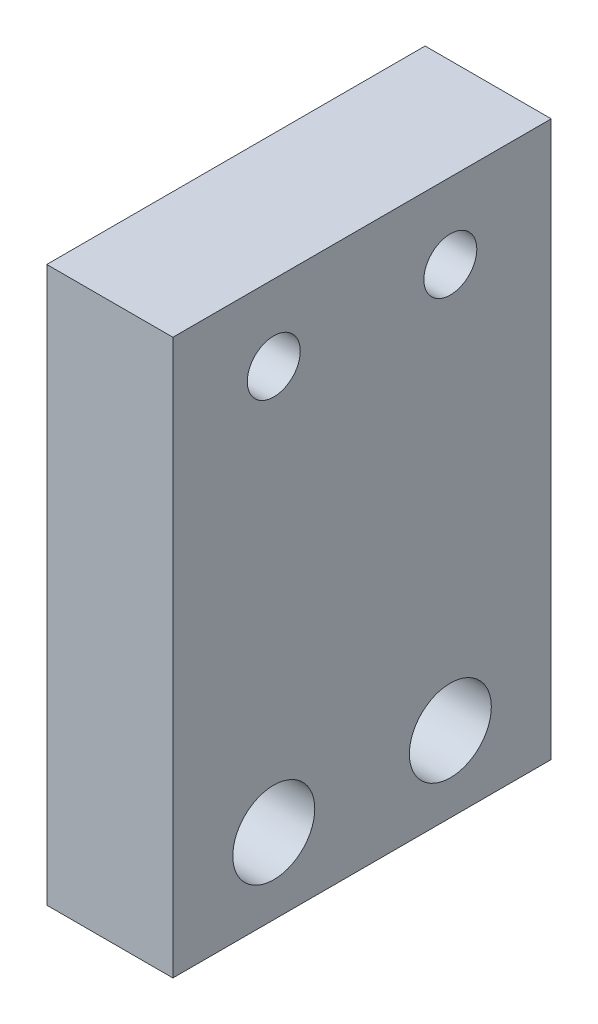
ISO-10303-21;
HEADER;
FILE_DESCRIPTION(('STEP AP214'),'2;1');
FILE_NAME('part.step','',(''),(''),'','','');
FILE_SCHEMA(('AUTOMOTIVE_DESIGN { 1 0 10303 214 1 1 1 1 }'));
ENDSEC;
DATA;
#1=APPLICATION_CONTEXT('core data for automotive mechanical design processes');
#2=APPLICATION_PROTOCOL_DEFINITION('international standard','automotive_design',2000,#1);
#3=PRODUCT_CONTEXT('',#1,'mechanical');
#4=PRODUCT('Part','Part','',(#3));
#5=PRODUCT_RELATED_PRODUCT_CATEGORY('part','',(#4));
#6=PRODUCT_DEFINITION_FORMATION('','',#4);
#7=PRODUCT_DEFINITION_CONTEXT('part definition',#1,'design');
#8=PRODUCT_DEFINITION('design','',#6,#7);
#9=PRODUCT_DEFINITION_SHAPE('','',#8);
#10=(LENGTH_UNIT() NAMED_UNIT(*) SI_UNIT(.MILLI.,.METRE.));
#11=(NAMED_UNIT(*) PLANE_ANGLE_UNIT() SI_UNIT($,.RADIAN.));
#12=(NAMED_UNIT(*) SI_UNIT($,.STERADIAN.) SOLID_ANGLE_UNIT());
#13=UNCERTAINTY_MEASURE_WITH_UNIT(LENGTH_MEASURE(1.E-05),#10,'distance_accuracy_value','');
#14=(GEOMETRIC_REPRESENTATION_CONTEXT(3) GLOBAL_UNCERTAINTY_ASSIGNED_CONTEXT((#13)) GLOBAL_UNIT_ASSIGNED_CONTEXT((#10,
#11,#12)) REPRESENTATION_CONTEXT('',''));
#15=CARTESIAN_POINT('',(0.,0.,0.));
#16=DIRECTION('',(0.,0.,1.));
#17=DIRECTION('',(1.,0.,0.));
#18=AXIS2_PLACEMENT_3D('',#15,#16,#17);
#19=CARTESIAN_POINT('',(-20.,6.,22.));
#20=DIRECTION('',(1.,0.,0.));
#21=DIRECTION('',(0.,0.,-1.));
#22=AXIS2_PLACEMENT_3D('',#19,#20,#21);
#23=CYLINDRICAL_SURFACE('',#22,3.25);
#24=CARTESIAN_POINT('',(10.,6.,22.));
#25=DIRECTION('',(1.,0.,0.));
#26=DIRECTION('',(0.,0.,-1.));
#27=AXIS2_PLACEMENT_3D('',#24,#25,#26);
#28=CIRCLE('',#27,3.25);
#29=CARTESIAN_POINT('',(10.,6.,18.75));
#30=VERTEX_POINT('',#29);
#31=EDGE_CURVE('E102',#30,#30,#28,.T.);
#32=ORIENTED_EDGE('',*,*,#31,.T.);
#33=EDGE_LOOP('',(#32));
#34=FACE_BOUND('',#33,.T.);
#35=CARTESIAN_POINT('',(4.5,6.,22.));
#36=DIRECTION('',(-1.,0.,0.));
#37=DIRECTION('',(0.,0.,1.));
#38=AXIS2_PLACEMENT_3D('',#35,#36,#37);
#39=CIRCLE('',#38,3.25);
#40=CARTESIAN_POINT('',(4.5,6.,25.25));
#41=VERTEX_POINT('',#40);
#42=EDGE_CURVE('E36',#41,#41,#39,.F.);
#43=ORIENTED_EDGE('',*,*,#42,.F.);
#44=EDGE_LOOP('',(#43));
#45=FACE_BOUND('',#44,.T.);
#46=ADVANCED_FACE('F32',(#34,#45),#23,.F.);
#47=CARTESIAN_POINT('',(-20.,6.,8.));
#48=DIRECTION('',(1.,0.,0.));
#49=DIRECTION('',(0.,0.,-1.));
#50=AXIS2_PLACEMENT_3D('',#47,#48,#49);
#51=CYLINDRICAL_SURFACE('',#50,3.25);
#52=CARTESIAN_POINT('',(10.,6.,8.));
#53=DIRECTION('',(1.,0.,0.));
#54=DIRECTION('',(0.,0.,-1.));
#55=AXIS2_PLACEMENT_3D('',#52,#53,#54);
#56=CIRCLE('',#55,3.25);
#57=CARTESIAN_POINT('',(10.,6.,4.75));
#58=VERTEX_POINT('',#57);
#59=EDGE_CURVE('E135',#58,#58,#56,.T.);
#60=ORIENTED_EDGE('',*,*,#59,.T.);
#61=EDGE_LOOP('',(#60));
#62=FACE_BOUND('',#61,.T.);
#63=CARTESIAN_POINT('',(4.5,6.,8.));
#64=DIRECTION('',(-1.,0.,0.));
#65=DIRECTION('',(0.,0.,1.));
#66=AXIS2_PLACEMENT_3D('',#63,#64,#65);
#67=CIRCLE('',#66,3.25);
#68=CARTESIAN_POINT('',(4.5,6.,11.25));
#69=VERTEX_POINT('',#68);
#70=EDGE_CURVE('E107',#69,#69,#67,.F.);
#71=ORIENTED_EDGE('',*,*,#70,.F.);
#72=EDGE_LOOP('',(#71));
#73=FACE_BOUND('',#72,.T.);
#74=ADVANCED_FACE('F155',(#62,#73),#51,.F.);
#75=CARTESIAN_POINT('',(0.,0.,30.));
#76=DIRECTION('',(1.,0.,0.));
#77=DIRECTION('',(0.,0.,-1.));
#78=AXIS2_PLACEMENT_3D('',#75,#76,#77);
#79=PLANE('',#78);
#80=CARTESIAN_POINT('',(0.,6.,22.));
#81=DIRECTION('',(-1.,0.,0.));
#82=DIRECTION('',(0.,0.,1.));
#83=AXIS2_PLACEMENT_3D('',#80,#81,#82);
#84=CIRCLE('',#83,5.5);
#85=CARTESIAN_POINT('',(0.,6.,27.5));
#86=VERTEX_POINT('',#85);
#87=EDGE_CURVE('E124',#86,#86,#84,.T.);
#88=ORIENTED_EDGE('',*,*,#87,.F.);
#89=EDGE_LOOP('',(#88));
#90=FACE_BOUND('',#89,.T.);
#91=CARTESIAN_POINT('',(0.,6.,8.));
#92=DIRECTION('',(-1.,0.,0.));
#93=DIRECTION('',(0.,0.,1.));
#94=AXIS2_PLACEMENT_3D('',#91,#92,#93);
#95=CIRCLE('',#94,5.5);
#96=CARTESIAN_POINT('',(0.,6.,13.5));
#97=VERTEX_POINT('',#96);
#98=EDGE_CURVE('E117',#97,#97,#95,.T.);
#99=ORIENTED_EDGE('',*,*,#98,.F.);
#100=EDGE_LOOP('',(#99));
#101=FACE_BOUND('',#100,.T.);
#102=CARTESIAN_POINT('',(0.,37.9999999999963,8.));
#103=DIRECTION('',(1.,0.,0.));
#104=DIRECTION('',(0.,0.,-1.));
#105=AXIS2_PLACEMENT_3D('',#102,#103,#104);
#106=CIRCLE('',#105,2.1);
#107=CARTESIAN_POINT('',(0.,37.9999999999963,5.9));
#108=VERTEX_POINT('',#107);
#109=EDGE_CURVE('E114',#108,#108,#106,.T.);
#110=ORIENTED_EDGE('',*,*,#109,.T.);
#111=EDGE_LOOP('',(#110));
#112=FACE_BOUND('',#111,.T.);
#113=CARTESIAN_POINT('',(0.,37.9999999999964,22.));
#114=DIRECTION('',(1.,0.,0.));
#115=DIRECTION('',(0.,0.,-1.));
#116=AXIS2_PLACEMENT_3D('',#113,#114,#115);
#117=CIRCLE('',#116,2.1);
#118=CARTESIAN_POINT('',(0.,37.9999999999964,19.9));
#119=VERTEX_POINT('',#118);
#120=EDGE_CURVE('E132',#119,#119,#117,.T.);
#121=ORIENTED_EDGE('',*,*,#120,.T.);
#122=EDGE_LOOP('',(#121));
#123=FACE_BOUND('',#122,.T.);
#124=DIRECTION('',(0.,-1.,0.));
#125=VECTOR('',#124,1.);
#126=CARTESIAN_POINT('',(0.,0.,0.));
#127=LINE('',#126,#125);
#128=CARTESIAN_POINT('',(0.,44.,0.));
#129=VERTEX_POINT('',#128);
#130=CARTESIAN_POINT('',(0.,0.,0.));
#131=VERTEX_POINT('',#130);
#132=EDGE_CURVE('E99',#129,#131,#127,.T.);
#133=ORIENTED_EDGE('',*,*,#132,.T.);
#134=DIRECTION('',(0.,0.,-1.));
#135=VECTOR('',#134,1.);
#136=CARTESIAN_POINT('',(0.,0.,30.));
#137=LINE('',#136,#135);
#138=CARTESIAN_POINT('',(0.,0.,30.));
#139=VERTEX_POINT('',#138);
#140=EDGE_CURVE('E11',#139,#131,#137,.T.);
#141=ORIENTED_EDGE('',*,*,#140,.F.);
#142=DIRECTION('',(0.,-1.,0.));
#143=VECTOR('',#142,1.);
#144=CARTESIAN_POINT('',(0.,0.,30.));
#145=LINE('',#144,#143);
#146=CARTESIAN_POINT('',(0.,44.,30.));
#147=VERTEX_POINT('',#146);
#148=EDGE_CURVE('E86',#147,#139,#145,.T.);
#149=ORIENTED_EDGE('',*,*,#148,.F.);
#150=DIRECTION('',(0.,0.,-1.));
#151=VECTOR('',#150,1.);
#152=CARTESIAN_POINT('',(0.,44.,30.));
#153=LINE('',#152,#151);
#154=EDGE_CURVE('E95',#147,#129,#153,.T.);
#155=ORIENTED_EDGE('',*,*,#154,.T.);
#156=EDGE_LOOP('',(#133,#141,#149,#155));
#157=FACE_BOUND('',#156,.T.);
#158=ADVANCED_FACE('F34',(#90,#101,#112,#123,#157),#79,.F.);
#159=CARTESIAN_POINT('',(0.,0.,30.));
#160=DIRECTION('',(0.,1.,0.));
#161=DIRECTION('',(0.,0.,1.));
#162=AXIS2_PLACEMENT_3D('',#159,#160,#161);
#163=PLANE('',#162);
#164=DIRECTION('',(1.,0.,0.));
#165=VECTOR('',#164,1.);
#166=CARTESIAN_POINT('',(0.,0.,0.));
#167=LINE('',#166,#165);
#168=CARTESIAN_POINT('',(10.,0.,0.));
#169=VERTEX_POINT('',#168);
#170=EDGE_CURVE('E90',#131,#169,#167,.T.);
#171=ORIENTED_EDGE('',*,*,#170,.T.);
#172=DIRECTION('',(0.,0.,-1.));
#173=VECTOR('',#172,1.);
#174=CARTESIAN_POINT('',(10.,0.,30.));
#175=LINE('',#174,#173);
#176=CARTESIAN_POINT('',(10.,0.,30.));
#177=VERTEX_POINT('',#176);
#178=EDGE_CURVE('E42',#177,#169,#175,.T.);
#179=ORIENTED_EDGE('',*,*,#178,.F.);
#180=DIRECTION('',(1.,0.,0.));
#181=VECTOR('',#180,1.);
#182=CARTESIAN_POINT('',(0.,0.,30.));
#183=LINE('',#182,#181);
#184=EDGE_CURVE('E81',#139,#177,#183,.T.);
#185=ORIENTED_EDGE('',*,*,#184,.F.);
#186=ORIENTED_EDGE('',*,*,#140,.T.);
#187=EDGE_LOOP('',(#171,#179,#185,#186));
#188=FACE_BOUND('',#187,.T.);
#189=ADVANCED_FACE('F89',(#188),#163,.F.);
#190=CARTESIAN_POINT('',(10.,0.,30.));
#191=DIRECTION('',(-1.,0.,0.));
#192=DIRECTION('',(0.,0.,1.));
#193=AXIS2_PLACEMENT_3D('',#190,#191,#192);
#194=PLANE('',#193);
#195=CARTESIAN_POINT('',(10.,37.9999999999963,8.));
#196=DIRECTION('',(1.,0.,0.));
#197=DIRECTION('',(0.,0.,-1.));
#198=AXIS2_PLACEMENT_3D('',#195,#196,#197);
#199=CIRCLE('',#198,2.1);
#200=CARTESIAN_POINT('',(10.,37.9999999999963,5.9));
#201=VERTEX_POINT('',#200);
#202=EDGE_CURVE('E109',#201,#201,#199,.T.);
#203=ORIENTED_EDGE('',*,*,#202,.F.);
#204=EDGE_LOOP('',(#203));
#205=FACE_BOUND('',#204,.T.);
#206=CARTESIAN_POINT('',(10.,37.9999999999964,22.));
#207=DIRECTION('',(1.,0.,0.));
#208=DIRECTION('',(0.,0.,-1.));
#209=AXIS2_PLACEMENT_3D('',#206,#207,#208);
#210=CIRCLE('',#209,2.1);
#211=CARTESIAN_POINT('',(10.,37.9999999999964,19.9));
#212=VERTEX_POINT('',#211);
#213=EDGE_CURVE('E129',#212,#212,#210,.T.);
#214=ORIENTED_EDGE('',*,*,#213,.F.);
#215=EDGE_LOOP('',(#214));
#216=FACE_BOUND('',#215,.T.);
#217=ORIENTED_EDGE('',*,*,#59,.F.);
#218=EDGE_LOOP('',(#217));
#219=FACE_BOUND('',#218,.T.);
#220=ORIENTED_EDGE('',*,*,#31,.F.);
#221=EDGE_LOOP('',(#220));
#222=FACE_BOUND('',#221,.T.);
#223=DIRECTION('',(0.,1.,0.));
#224=VECTOR('',#223,1.);
#225=CARTESIAN_POINT('',(10.,0.,0.));
#226=LINE('',#225,#224);
#227=CARTESIAN_POINT('',(10.,44.,0.));
#228=VERTEX_POINT('',#227);
#229=EDGE_CURVE('E68',#169,#228,#226,.T.);
#230=ORIENTED_EDGE('',*,*,#229,.T.);
#231=DIRECTION('',(0.,0.,-1.));
#232=VECTOR('',#231,1.);
#233=CARTESIAN_POINT('',(10.,44.,30.));
#234=LINE('',#233,#232);
#235=CARTESIAN_POINT('',(10.,44.,30.));
#236=VERTEX_POINT('',#235);
#237=EDGE_CURVE('E91',#236,#228,#234,.T.);
#238=ORIENTED_EDGE('',*,*,#237,.F.);
#239=DIRECTION('',(0.,1.,0.));
#240=VECTOR('',#239,1.);
#241=CARTESIAN_POINT('',(10.,0.,30.));
#242=LINE('',#241,#240);
#243=EDGE_CURVE('E84',#177,#236,#242,.T.);
#244=ORIENTED_EDGE('',*,*,#243,.F.);
#245=ORIENTED_EDGE('',*,*,#178,.T.);
#246=EDGE_LOOP('',(#230,#238,#244,#245));
#247=FACE_BOUND('',#246,.T.);
#248=ADVANCED_FACE('F93',(#205,#216,#219,#222,#247),#194,.F.);
#249=CARTESIAN_POINT('',(0.,44.,30.));
#250=DIRECTION('',(0.,-1.,0.));
#251=DIRECTION('',(0.,0.,-1.));
#252=AXIS2_PLACEMENT_3D('',#249,#250,#251);
#253=PLANE('',#252);
#254=DIRECTION('',(-1.,0.,0.));
#255=VECTOR('',#254,1.);
#256=CARTESIAN_POINT('',(0.,44.,0.));
#257=LINE('',#256,#255);
#258=EDGE_CURVE('E74',#228,#129,#257,.T.);
#259=ORIENTED_EDGE('',*,*,#258,.T.);
#260=ORIENTED_EDGE('',*,*,#154,.F.);
#261=DIRECTION('',(-1.,0.,0.));
#262=VECTOR('',#261,1.);
#263=CARTESIAN_POINT('',(0.,44.,30.));
#264=LINE('',#263,#262);
#265=EDGE_CURVE('E51',#236,#147,#264,.T.);
#266=ORIENTED_EDGE('',*,*,#265,.F.);
#267=ORIENTED_EDGE('',*,*,#237,.T.);
#268=EDGE_LOOP('',(#259,#260,#266,#267));
#269=FACE_BOUND('',#268,.T.);
#270=ADVANCED_FACE('F144',(#269),#253,.F.);
#271=CARTESIAN_POINT('',(0.,44.,30.));
#272=DIRECTION('',(0.,0.,-1.));
#273=DIRECTION('',(-1.,0.,0.));
#274=AXIS2_PLACEMENT_3D('',#271,#272,#273);
#275=PLANE('',#274);
#276=ORIENTED_EDGE('',*,*,#148,.T.);
#277=ORIENTED_EDGE('',*,*,#184,.T.);
#278=ORIENTED_EDGE('',*,*,#243,.T.);
#279=ORIENTED_EDGE('',*,*,#265,.T.);
#280=EDGE_LOOP('',(#276,#277,#278,#279));
#281=FACE_BOUND('',#280,.T.);
#282=ADVANCED_FACE('F82',(#281),#275,.F.);
#283=CARTESIAN_POINT('',(0.,44.,0.));
#284=DIRECTION('',(0.,0.,-1.));
#285=DIRECTION('',(-1.,0.,0.));
#286=AXIS2_PLACEMENT_3D('',#283,#284,#285);
#287=PLANE('',#286);
#288=ORIENTED_EDGE('',*,*,#132,.F.);
#289=ORIENTED_EDGE('',*,*,#258,.F.);
#290=ORIENTED_EDGE('',*,*,#229,.F.);
#291=ORIENTED_EDGE('',*,*,#170,.F.);
#292=EDGE_LOOP('',(#288,#289,#290,#291));
#293=FACE_BOUND('',#292,.T.);
#294=ADVANCED_FACE('F166',(#293),#287,.T.);
#295=CARTESIAN_POINT('',(-20.,37.9999999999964,22.));
#296=DIRECTION('',(1.,0.,0.));
#297=DIRECTION('',(0.,0.,-1.));
#298=AXIS2_PLACEMENT_3D('',#295,#296,#297);
#299=CYLINDRICAL_SURFACE('',#298,2.1);
#300=ORIENTED_EDGE('',*,*,#213,.T.);
#301=EDGE_LOOP('',(#300));
#302=FACE_BOUND('',#301,.T.);
#303=ORIENTED_EDGE('',*,*,#120,.F.);
#304=EDGE_LOOP('',(#303));
#305=FACE_BOUND('',#304,.T.);
#306=ADVANCED_FACE('F168',(#302,#305),#299,.F.);
#307=CARTESIAN_POINT('',(-20.,37.9999999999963,8.));
#308=DIRECTION('',(1.,0.,0.));
#309=DIRECTION('',(0.,0.,-1.));
#310=AXIS2_PLACEMENT_3D('',#307,#308,#309);
#311=CYLINDRICAL_SURFACE('',#310,2.1);
#312=ORIENTED_EDGE('',*,*,#202,.T.);
#313=EDGE_LOOP('',(#312));
#314=FACE_BOUND('',#313,.T.);
#315=ORIENTED_EDGE('',*,*,#109,.F.);
#316=EDGE_LOOP('',(#315));
#317=FACE_BOUND('',#316,.T.);
#318=ADVANCED_FACE('F173',(#314,#317),#311,.F.);
#319=CARTESIAN_POINT('',(4.5,6.,8.));
#320=DIRECTION('',(-1.,0.,0.));
#321=DIRECTION('',(0.,0.,1.));
#322=AXIS2_PLACEMENT_3D('',#319,#320,#321);
#323=PLANE('',#322);
#324=CARTESIAN_POINT('',(4.5,6.,8.));
#325=DIRECTION('',(-1.,0.,0.));
#326=DIRECTION('',(0.,0.,1.));
#327=AXIS2_PLACEMENT_3D('',#324,#325,#326);
#328=CIRCLE('',#327,5.5);
#329=CARTESIAN_POINT('',(4.5,6.,13.5));
#330=VERTEX_POINT('',#329);
#331=EDGE_CURVE('E110',#330,#330,#328,.T.);
#332=ORIENTED_EDGE('',*,*,#331,.T.);
#333=EDGE_LOOP('',(#332));
#334=FACE_BOUND('',#333,.T.);
#335=ORIENTED_EDGE('',*,*,#70,.T.);
#336=EDGE_LOOP('',(#335));
#337=FACE_BOUND('',#336,.T.);
#338=ADVANCED_FACE('F192',(#334,#337),#323,.T.);
#339=CARTESIAN_POINT('',(4.5,6.,8.));
#340=DIRECTION('',(-1.,0.,0.));
#341=DIRECTION('',(0.,0.,1.));
#342=AXIS2_PLACEMENT_3D('',#339,#340,#341);
#343=CYLINDRICAL_SURFACE('',#342,5.5);
#344=ORIENTED_EDGE('',*,*,#331,.F.);
#345=EDGE_LOOP('',(#344));
#346=FACE_BOUND('',#345,.T.);
#347=ORIENTED_EDGE('',*,*,#98,.T.);
#348=EDGE_LOOP('',(#347));
#349=FACE_BOUND('',#348,.T.);
#350=ADVANCED_FACE('F198',(#346,#349),#343,.F.);
#351=CARTESIAN_POINT('',(4.5,6.,22.));
#352=DIRECTION('',(-1.,0.,0.));
#353=DIRECTION('',(0.,0.,1.));
#354=AXIS2_PLACEMENT_3D('',#351,#352,#353);
#355=PLANE('',#354);
#356=CARTESIAN_POINT('',(4.5,6.,22.));
#357=DIRECTION('',(-1.,0.,0.));
#358=DIRECTION('',(0.,0.,1.));
#359=AXIS2_PLACEMENT_3D('',#356,#357,#358);
#360=CIRCLE('',#359,5.5);
#361=CARTESIAN_POINT('',(4.5,6.,27.5));
#362=VERTEX_POINT('',#361);
#363=EDGE_CURVE('E216',#362,#362,#360,.T.);
#364=ORIENTED_EDGE('',*,*,#363,.T.);
#365=EDGE_LOOP('',(#364));
#366=FACE_BOUND('',#365,.T.);
#367=ORIENTED_EDGE('',*,*,#42,.T.);
#368=EDGE_LOOP('',(#367));
#369=FACE_BOUND('',#368,.T.);
#370=ADVANCED_FACE('F202',(#366,#369),#355,.T.);
#371=CARTESIAN_POINT('',(4.5,6.,22.));
#372=DIRECTION('',(-1.,0.,0.));
#373=DIRECTION('',(0.,0.,1.));
#374=AXIS2_PLACEMENT_3D('',#371,#372,#373);
#375=CYLINDRICAL_SURFACE('',#374,5.5);
#376=ORIENTED_EDGE('',*,*,#363,.F.);
#377=EDGE_LOOP('',(#376));
#378=FACE_BOUND('',#377,.T.);
#379=ORIENTED_EDGE('',*,*,#87,.T.);
#380=EDGE_LOOP('',(#379));
#381=FACE_BOUND('',#380,.T.);
#382=ADVANCED_FACE('F205',(#378,#381),#375,.F.);
#383=CLOSED_SHELL('',(#46,#74,#158,#189,#248,#270,#282,#294,#306,#318,#338,#350,#370,#382));
#384=MANIFOLD_SOLID_BREP('B2',#383);
#385=ADVANCED_BREP_SHAPE_REPRESENTATION('',(#18,#384),#14);
#386=SHAPE_DEFINITION_REPRESENTATION(#9,#385);
ENDSEC;
END-ISO-10303-21;
